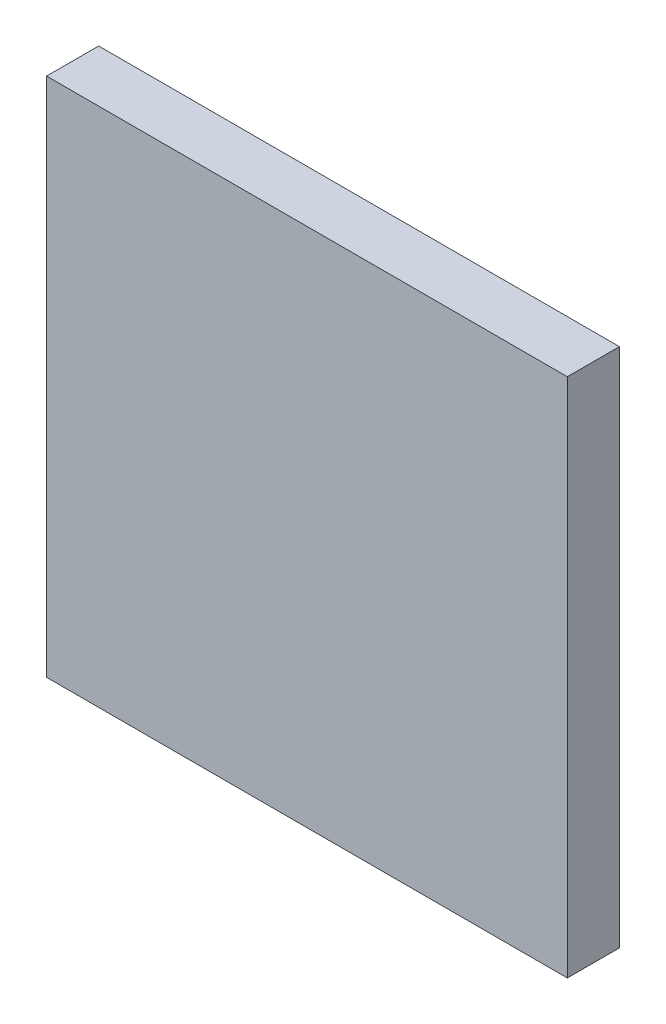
from build123d import *

# Parameters (mm, degrees)
SKETCH1_W           = 1000
SKETCH1_H           = 1000
BOSS_EXTRUDE1_DEPTH = 100


with BuildPart() as part:
    # Sketch1 → Boss-Extrude1 (new body)
    with BuildSketch(Plane(origin=(0, 0, 0), x_dir=(1, 0, 0), z_dir=(0, 0, -1))):
        with Locations((500, -500)):
            Rectangle(SKETCH1_W, SKETCH1_H)
    extrude(amount=BOSS_EXTRUDE1_DEPTH)


solid = part.part
